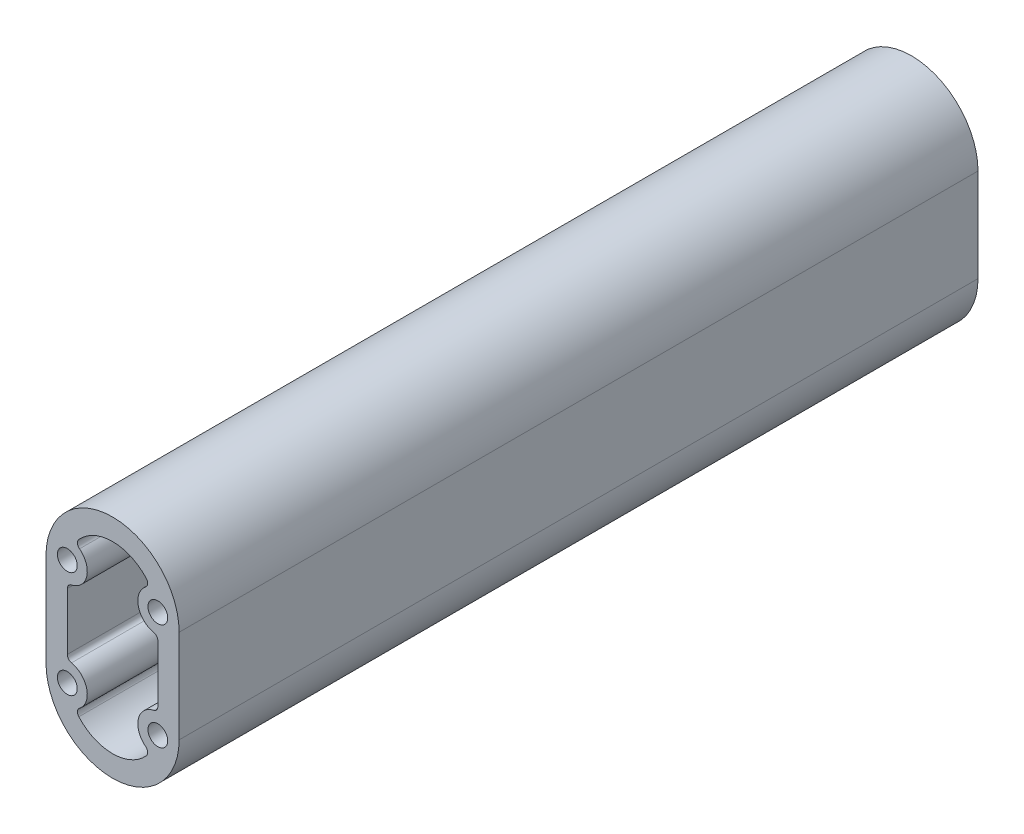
from build123d import *

# Parameters (mm, degrees)
SKIZZE1_R               = 3.725000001
LINEAR_AUSTRAGEN1_DEPTH = 300


with BuildPart() as part:
    # Skizze1 → Linear austragen1 (new body)
    with BuildSketch(Plane.XY):
        with BuildLine():
            Line((25, -17.5), (25, 17.5))
            ThreePointArc((25, 17.5), (0, 42.5), (-25, 17.5))
            Line((-25, 17.5), (-25, -17.5))
            ThreePointArc((-25, -17.5), (0, -42.5), (25, -17.5))
        make_face()
        with Locations((17, -20)):
            Circle(SKIZZE1_R, mode=Mode.SUBTRACT)
        with Locations((-17, -20)):
            Circle(SKIZZE1_R, mode=Mode.SUBTRACT)
        with Locations((17, 20)):
            Circle(SKIZZE1_R, mode=Mode.SUBTRACT)
        with Locations((-17, 20)):
            Circle(SKIZZE1_R, mode=Mode.SUBTRACT)
        with BuildLine():
            Line((-17, 10.712988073), (-17, -10.712988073))
            ThreePointArc((-17, -10.712988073), (-16.555974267, -11.96954849), (-15.421055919, -12.668163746))
            ThreePointArc((-15.421055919, -12.668163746), (-9.687315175, -18.334608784), (-12.401924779, -25.925081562))
            ThreePointArc((-12.401924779, -25.925081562), (-13.167605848, -27.324710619), (-12.665860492, -28.839134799))
            ThreePointArc((-12.665860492, -28.839134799), (0, -34.5), (12.665860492, -28.839134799))
            ThreePointArc((12.665860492, -28.839134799), (13.167605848, -27.324710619), (12.401924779, -25.925081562))
            ThreePointArc((12.401924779, -25.925081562), (9.687315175, -18.334608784), (15.421055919, -12.668163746))
            ThreePointArc((15.421055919, -12.668163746), (16.555974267, -11.96954849), (17, -10.712988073))
            Line((17, -10.712988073), (17, 10.71314457))
            ThreePointArc((17, 10.71314457), (16.556023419, 11.969644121), (15.42120888, 12.668287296))
            ThreePointArc((15.42120888, 12.668287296), (9.688024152, 18.334685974), (12.402312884, 25.924818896))
            ThreePointArc((12.402312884, 25.924818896), (13.167906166, 27.32440515), (12.666198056, 28.838757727))
            ThreePointArc((12.666198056, 28.838757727), (0.000253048, 34.499999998), (-12.665860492, 28.839134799))
            ThreePointArc((-12.665860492, 28.839134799), (-13.167605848, 27.324710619), (-12.401924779, 25.925081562))
            ThreePointArc((-12.401924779, 25.925081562), (-9.687315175, 18.334608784), (-15.421055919, 12.668163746))
            ThreePointArc((-15.421055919, 12.668163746), (-16.555974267, 11.96954849), (-17, 10.712988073))
        make_face(mode=Mode.SUBTRACT)
    extrude(amount=LINEAR_AUSTRAGEN1_DEPTH)


solid = part.part
